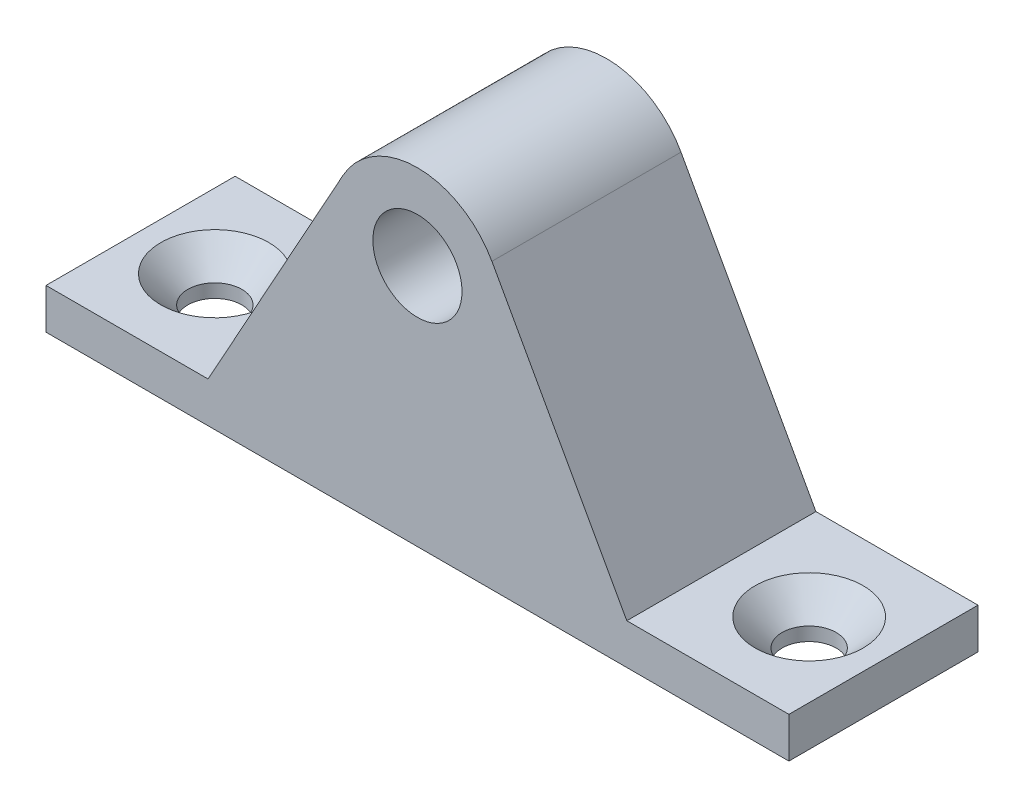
from build123d import *

# Parameters (mm, degrees)
ESQUISSE1_R             = 3.3
BOSS_EXTRU_1_DEPTH      = 7
ESQUISSE2_R             = 2
ENL_V_MAT_EXTRU_1_DEPTH = 36.481544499
CHANFREIN1_SIZE         = 2
BOSS_EXTRU_2_DEPTH      = 8
ESQUISSE4_R             = 1.25
ENL_V_MAT_EXTRU_2_DEPTH = 43.457471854
ENL_V_START             = -4
ESQUISSE5_R             = 3
ENL_V_MAT_EXTRU_3_DEPTH = 39.457471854


with BuildPart() as part:
    # Esquisse1 → Boss.-Extru.1 (new, symmetric)
    with BuildSketch(Plane.XY):
        with BuildLine():
            Line((-27.5, 0), (27.5, 0))
            Line((27.5, 0), (27.5, 3))
            Line((27.5, 3), (15.5, 3))
            Line((15.5, 3), (5.512402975, 21.050149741))
            ThreePointArc((5.512402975, 21.050149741), (0, 24.3), (-5.512402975, 21.050149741))
            Line((-5.512402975, 21.050149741), (-15.5, 3))
            Line((-15.5, 3), (-27.5, 3))
            Line((-27.5, 3), (-27.5, 0))
        make_face()
        with Locations((0, 18)):
            Circle(ESQUISSE1_R, mode=Mode.SUBTRACT)
    extrude(amount=BOSS_EXTRU_1_DEPTH, both=True)

    # Esquisse2 → Enl_v. mat.-Extru.1 (cut, through all)
    with BuildSketch(Plane(origin=(0, 3, 0), x_dir=(1, 0, 0), z_dir=(0, 1, 0))):
        with Locations(Location((-22, 0, 0), (0, 0, 180))):
            Circle(ESQUISSE2_R)
        with Locations(Location((22, 0, 0), (0, 0, 180))):
            Circle(ESQUISSE2_R)
    extrude(amount=-ENL_V_MAT_EXTRU_1_DEPTH, mode=Mode.SUBTRACT)

    # Chanfrein1
    chanfrein1_edges = [part.edges().sort_by_distance(p)[0] for p in [
        (-20, 3, 0),
        (24, 3, 0),
    ]]
    chamfer(chanfrein1_edges, length=CHANFREIN1_SIZE)

    # Esquisse3 → Boss.-Extru.2 (add)
    with BuildSketch(Plane(origin=(0, 0, -7), x_dir=(-1, 0, 0), z_dir=(0, 0, -1))):
        Polygon((11.72298723, 9.826030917), (17.159974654, 0), (3.918894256, 0), (3.918894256, 9.826030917), align=None)
    extrude(amount=BOSS_EXTRU_2_DEPTH)

    # Esquisse4 → Enl_v. mat.-Extru.2 (cut, through all)
    with BuildSketch(Plane(origin=(-3.918894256, 0, 0), x_dir=(0, 0, -1), z_dir=(1, 0, 0))):
        with Locations((10.846318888, 6.309882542)):
            Circle(ESQUISSE4_R)
    extrude(amount=-ENL_V_MAT_EXTRU_2_DEPTH, mode=Mode.SUBTRACT)

    # Esquisse5 → Enl_v. mat.-Extru.3 (cut, through all)
    with BuildSketch(Plane(origin=(-3.918894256, 0, 0), x_dir=(0, 0, -1), z_dir=(1, 0, 0)).offset(ENL_V_START)):
        with Locations((10.846318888, 6.309882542)):
            Circle(ESQUISSE5_R)
    extrude(amount=-ENL_V_MAT_EXTRU_3_DEPTH, mode=Mode.SUBTRACT)


solid = part.part
